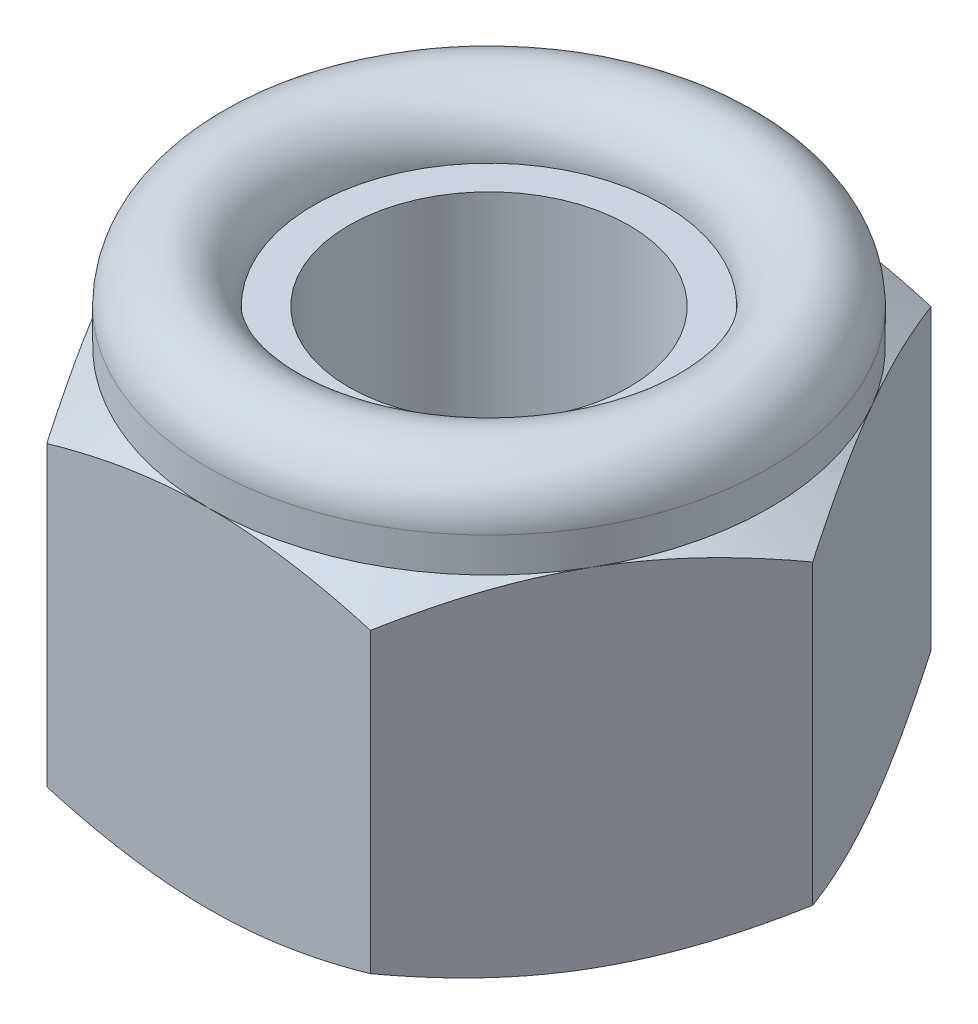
ISO-10303-21;
HEADER;
FILE_DESCRIPTION(('STEP AP214'),'2;1');
FILE_NAME('part.step','',(''),(''),'','','');
FILE_SCHEMA(('AUTOMOTIVE_DESIGN { 1 0 10303 214 1 1 1 1 }'));
ENDSEC;
DATA;
#1=APPLICATION_CONTEXT('core data for automotive mechanical design processes');
#2=APPLICATION_PROTOCOL_DEFINITION('international standard','automotive_design',2000,#1);
#3=PRODUCT_CONTEXT('',#1,'mechanical');
#4=PRODUCT('Part','Part','',(#3));
#5=PRODUCT_RELATED_PRODUCT_CATEGORY('part','',(#4));
#6=PRODUCT_DEFINITION_FORMATION('','',#4);
#7=PRODUCT_DEFINITION_CONTEXT('part definition',#1,'design');
#8=PRODUCT_DEFINITION('design','',#6,#7);
#9=PRODUCT_DEFINITION_SHAPE('','',#8);
#10=(LENGTH_UNIT() NAMED_UNIT(*) SI_UNIT(.MILLI.,.METRE.));
#11=(NAMED_UNIT(*) PLANE_ANGLE_UNIT() SI_UNIT($,.RADIAN.));
#12=(NAMED_UNIT(*) SI_UNIT($,.STERADIAN.) SOLID_ANGLE_UNIT());
#13=UNCERTAINTY_MEASURE_WITH_UNIT(LENGTH_MEASURE(1.E-05),#10,'distance_accuracy_value','');
#14=(GEOMETRIC_REPRESENTATION_CONTEXT(3) GLOBAL_UNCERTAINTY_ASSIGNED_CONTEXT((#13)) GLOBAL_UNIT_ASSIGNED_CONTEXT((#10,
#11,#12)) REPRESENTATION_CONTEXT('',''));
#15=CARTESIAN_POINT('',(0.,0.,0.));
#16=DIRECTION('',(0.,0.,1.));
#17=DIRECTION('',(1.,0.,0.));
#18=AXIS2_PLACEMENT_3D('',#15,#16,#17);
#19=CARTESIAN_POINT('',(0.,0.,0.));
#20=DIRECTION('',(0.,1.,0.));
#21=DIRECTION('',(0.,0.,1.));
#22=AXIS2_PLACEMENT_3D('',#19,#20,#21);
#23=CONICAL_SURFACE('',#22,8.00000001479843,1.04719754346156);
#24=CARTESIAN_POINT('',(9.23771977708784,0.714597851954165,0.000199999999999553));
#25=CARTESIAN_POINT('',(9.13619343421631,0.655990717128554,-0.175648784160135));
#26=CARTESIAN_POINT('',(9.03428856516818,0.600043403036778,-0.35215319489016));
#27=CARTESIAN_POINT('',(8.82965122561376,0.494201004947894,-0.706595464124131));
#28=CARTESIAN_POINT('',(8.72691841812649,0.444308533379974,-0.884533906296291));
#29=CARTESIAN_POINT('',(8.41707512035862,0.304692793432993,-1.42119824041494));
#30=CARTESIAN_POINT('',(8.20874154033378,0.225281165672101,-1.78204258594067));
#31=CARTESIAN_POINT('',(7.89697436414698,0.132161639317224,-2.32203917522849));
#32=CARTESIAN_POINT('',(7.79447216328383,0.105634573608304,-2.4995781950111));
#33=CARTESIAN_POINT('',(7.58900421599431,0.0611531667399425,-2.85545911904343));
#34=CARTESIAN_POINT('',(7.48603851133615,0.0431980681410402,-3.0338009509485));
#35=CARTESIAN_POINT('',(7.2799298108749,0.0163156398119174,-3.39079169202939));
#36=CARTESIAN_POINT('',(7.17678714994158,0.00737806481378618,-3.56944002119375));
#37=CARTESIAN_POINT('',(6.97040654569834,-0.00127770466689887,-3.9269017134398));
#38=CARTESIAN_POINT('',(6.86716860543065,-0.000996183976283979,-4.1057150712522));
#39=CARTESIAN_POINT('',(6.67416138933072,0.00814501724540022,-4.44001337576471));
#40=CARTESIAN_POINT('',(6.58437849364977,0.0158895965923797,-4.59552191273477));
#41=CARTESIAN_POINT('',(6.40502298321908,0.0382011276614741,-4.90617476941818));
#42=CARTESIAN_POINT('',(6.31545038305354,0.0527685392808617,-5.06131906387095));
#43=CARTESIAN_POINT('',(6.04707935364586,0.106360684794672,-5.52615132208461));
#44=CARTESIAN_POINT('',(5.86875596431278,0.155268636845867,-5.83501649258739));
#45=CARTESIAN_POINT('',(5.51021755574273,0.277539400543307,-6.45602323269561));
#46=CARTESIAN_POINT('',(5.33004829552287,0.35142051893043,-6.76808554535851));
#47=CARTESIAN_POINT('',(4.97239658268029,0.519100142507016,-7.3875564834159));
#48=CARTESIAN_POINT('',(4.79490954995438,0.61285926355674,-7.69497304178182));
#49=CARTESIAN_POINT('',(4.61868668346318,0.714597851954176,-8.0002));
#50=B_SPLINE_CURVE_WITH_KNOTS('',3,(#24,#25,#26,#27,#28,#29,#30,#31,#32,#33,#34,#35,#36,#37,#38,
#39,#40,#41,#42,#43,#44,#45,#46,#47,#48,#49),.UNSPECIFIED.,.F.,.F.,(4,2,2,2,2,2,2,2,2,2,2,2,4),
(0.,0.633973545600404,1.2682196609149,2.53934713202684,3.15934344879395,3.7792849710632,
4.39852135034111,5.01773859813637,5.55680240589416,6.09590255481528,7.17487078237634,
8.27776850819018,9.37850115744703),.UNSPECIFIED.);
#51=CARTESIAN_POINT('',(9.237604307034,0.714531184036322,0.));
#52=VERTEX_POINT('',#51);
#53=CARTESIAN_POINT('',(6.92820323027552,0.,-3.99999999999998));
#54=VERTEX_POINT('',#53);
#55=EDGE_CURVE('E238',#52,#54,#50,.T.);
#56=ORIENTED_EDGE('',*,*,#55,.F.);
#57=CARTESIAN_POINT('',(4.61868668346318,0.714597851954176,8.0002));
#58=CARTESIAN_POINT('',(4.7202130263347,0.655990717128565,7.82435121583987));
#59=CARTESIAN_POINT('',(4.82211789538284,0.600043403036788,7.64784680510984));
#60=CARTESIAN_POINT('',(5.02675523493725,0.494201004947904,7.29340453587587));
#61=CARTESIAN_POINT('',(5.12948804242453,0.444308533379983,7.11546609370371));
#62=CARTESIAN_POINT('',(5.4393313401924,0.304692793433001,6.57880175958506));
#63=CARTESIAN_POINT('',(5.64766492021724,0.225281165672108,6.21795741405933));
#64=CARTESIAN_POINT('',(5.95943209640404,0.132161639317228,5.67796082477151));
#65=CARTESIAN_POINT('',(6.06193429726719,0.105634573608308,5.5004218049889));
#66=CARTESIAN_POINT('',(6.26740224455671,0.0611531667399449,5.14454088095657));
#67=CARTESIAN_POINT('',(6.37036794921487,0.0431980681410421,4.96619904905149));
#68=CARTESIAN_POINT('',(6.57647664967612,0.0163156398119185,4.60920830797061));
#69=CARTESIAN_POINT('',(6.67961931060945,0.00737806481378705,4.43055997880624));
#70=CARTESIAN_POINT('',(6.88599991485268,-0.00127770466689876,4.07309828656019));
#71=CARTESIAN_POINT('',(6.98923785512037,-0.000996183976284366,3.89428492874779));
#72=CARTESIAN_POINT('',(7.1822450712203,0.00814501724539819,3.55998662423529));
#73=CARTESIAN_POINT('',(7.27202796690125,0.0158895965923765,3.40447808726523));
#74=CARTESIAN_POINT('',(7.45138347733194,0.0382011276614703,3.09382523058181));
#75=CARTESIAN_POINT('',(7.54095607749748,0.0527685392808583,2.93868093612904));
#76=CARTESIAN_POINT('',(7.80932710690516,0.106360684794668,2.47384867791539));
#77=CARTESIAN_POINT('',(7.98765049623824,0.15526863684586,2.16498350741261));
#78=CARTESIAN_POINT('',(8.34618890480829,0.277539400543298,1.54397676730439));
#79=CARTESIAN_POINT('',(8.52635816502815,0.351420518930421,1.23191445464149));
#80=CARTESIAN_POINT('',(8.88400987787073,0.519100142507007,0.612443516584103));
#81=CARTESIAN_POINT('',(9.06149691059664,0.61285926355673,0.30502695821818));
#82=CARTESIAN_POINT('',(9.23771977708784,0.714597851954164,-0.000200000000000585));
#83=B_SPLINE_CURVE_WITH_KNOTS('',3,(#57,#58,#59,#60,#61,#62,#63,#64,#65,#66,#67,#68,#69,#70,#71,
#72,#73,#74,#75,#76,#77,#78,#79,#80,#81,#82),.UNSPECIFIED.,.F.,.F.,(4,2,2,2,2,2,2,2,2,2,2,2,4),
(0.,0.633973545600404,1.2682196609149,2.53934713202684,3.15934344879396,3.7792849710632,
4.39852135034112,5.01773859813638,5.55680240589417,6.09590255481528,7.17487078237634,
8.27776850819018,9.37850115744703),.UNSPECIFIED.);
#84=CARTESIAN_POINT('',(6.92820323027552,0.,3.99999999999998));
#85=VERTEX_POINT('',#84);
#86=EDGE_CURVE('E153',#85,#52,#83,.T.);
#87=ORIENTED_EDGE('',*,*,#86,.F.);
#88=CARTESIAN_POINT('',(0.,0.,0.));
#89=DIRECTION('',(0.,-1.,0.));
#90=DIRECTION('',(0.,0.,-1.));
#91=AXIS2_PLACEMENT_3D('',#88,#89,#90);
#92=CIRCLE('',#91,8.00000001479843);
#93=EDGE_CURVE('E251',#54,#85,#92,.T.);
#94=ORIENTED_EDGE('',*,*,#93,.F.);
#95=EDGE_LOOP('',(#56,#87,#94));
#96=FACE_BOUND('',#95,.T.);
#97=ADVANCED_FACE('F35',(#96),#23,.T.);
#98=CARTESIAN_POINT('',(4.61880215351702,0.714531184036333,-8.));
#99=VERTEX_POINT('',#98);
#100=EDGE_CURVE('E233',#54,#99,#50,.T.);
#101=ORIENTED_EDGE('',*,*,#100,.F.);
#102=CARTESIAN_POINT('',(0.,0.,-8.));
#103=VERTEX_POINT('',#102);
#104=EDGE_CURVE('E249',#103,#54,#92,.T.);
#105=ORIENTED_EDGE('',*,*,#104,.F.);
#106=CARTESIAN_POINT('',(-12.4167804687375,3.90912139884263,-8.));
#107=CARTESIAN_POINT('',(-12.0672904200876,3.73954675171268,-8.));
#108=CARTESIAN_POINT('',(-11.716999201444,3.57159509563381,-8.));
#109=CARTESIAN_POINT('',(-11.0143884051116,3.23985033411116,-8.));
#110=CARTESIAN_POINT('',(-10.6620685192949,3.07605788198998,-8.));
#111=CARTESIAN_POINT('',(-9.95316389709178,2.75272219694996,-8.));
#112=CARTESIAN_POINT('',(-9.59656639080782,2.59320686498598,-8.));
#113=CARTESIAN_POINT('',(-8.88053882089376,2.28069031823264,-8.));
#114=CARTESIAN_POINT('',(-8.52110889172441,2.12768879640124,-8.));
#115=CARTESIAN_POINT('',(-7.78718797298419,1.82511353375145,-8.));
#116=CARTESIAN_POINT('',(-7.41258514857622,1.67580955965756,-8.));
#117=CARTESIAN_POINT('',(-6.65900149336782,1.38847695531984,-8.));
#118=CARTESIAN_POINT('',(-6.28002017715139,1.25044958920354,-8.));
#119=CARTESIAN_POINT('',(-5.51777815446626,0.989286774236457,-8.));
#120=CARTESIAN_POINT('',(-5.13452785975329,0.866121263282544,-8.));
#121=CARTESIAN_POINT('',(-4.36254331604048,0.63862615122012,-8.));
#122=CARTESIAN_POINT('',(-3.97381083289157,0.534290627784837,-8.));
#123=CARTESIAN_POINT('',(-3.19274509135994,0.350020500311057,-8.));
#124=CARTESIAN_POINT('',(-2.80044413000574,0.269952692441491,-8.));
#125=CARTESIAN_POINT('',(-2.20841205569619,0.1715109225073,-8.));
#126=CARTESIAN_POINT('',(-2.01045675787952,0.142305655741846,-8.));
#127=CARTESIAN_POINT('',(-1.61355877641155,0.091687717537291,-8.));
#128=CARTESIAN_POINT('',(-1.41461619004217,0.0702742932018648,-8.));
#129=CARTESIAN_POINT('',(-1.01861322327,0.0359357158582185,-8.));
#130=CARTESIAN_POINT('',(-0.821562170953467,0.0229034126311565,-8.));
#131=CARTESIAN_POINT('',(-0.427085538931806,0.00518383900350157,-8.));
#132=CARTESIAN_POINT('',(-0.229659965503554,0.000496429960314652,-8.));
#133=CARTESIAN_POINT('',(0.165212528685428,-0.000421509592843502,-8.));
#134=CARTESIAN_POINT('',(0.362659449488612,0.00334797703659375,-8.));
#135=CARTESIAN_POINT('',(0.757218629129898,0.0192515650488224,-8.));
#136=CARTESIAN_POINT('',(0.954330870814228,0.031386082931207,-8.));
#137=CARTESIAN_POINT('',(1.42775544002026,0.0703195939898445,-8.));
#138=CARTESIAN_POINT('',(1.70374960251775,0.101071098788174,-8.));
#139=CARTESIAN_POINT('',(2.25368308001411,0.177298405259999,-8.));
#140=CARTESIAN_POINT('',(2.52762211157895,0.222776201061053,-8.));
#141=CARTESIAN_POINT('',(3.34604788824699,0.378887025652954,-8.));
#142=CARTESIAN_POINT('',(3.88683594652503,0.509168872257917,-8.));
#143=CARTESIAN_POINT('',(4.69544514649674,0.735008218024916,-8.));
#144=CARTESIAN_POINT('',(4.96746291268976,0.816403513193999,-8.));
#145=CARTESIAN_POINT('',(5.50885645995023,0.987629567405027,-8.));
#146=CARTESIAN_POINT('',(5.77823222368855,1.07746038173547,-8.));
#147=CARTESIAN_POINT('',(6.31442655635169,1.26411775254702,-8.));
#148=CARTESIAN_POINT('',(6.5812459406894,1.36094198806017,-8.));
#149=CARTESIAN_POINT('',(7.11267558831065,1.56044885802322,-8.));
#150=CARTESIAN_POINT('',(7.37728587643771,1.66313142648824,-8.));
#151=CARTESIAN_POINT('',(7.99738806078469,1.91040586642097,-8.));
#152=CARTESIAN_POINT('',(8.35207087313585,2.05702284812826,-8.));
#153=CARTESIAN_POINT('',(9.05844713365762,2.35730973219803,-8.));
#154=CARTESIAN_POINT('',(9.41014040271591,2.51098005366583,-8.));
#155=CARTESIAN_POINT('',(10.1110880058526,2.82397393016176,-8.));
#156=CARTESIAN_POINT('',(10.4603417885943,2.98329871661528,-8.));
#157=CARTESIAN_POINT('',(11.1567364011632,3.30647149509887,-8.));
#158=CARTESIAN_POINT('',(11.5038772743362,3.47031939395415,-8.));
#159=CARTESIAN_POINT('',(12.1967661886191,3.8018765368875,-8.));
#160=CARTESIAN_POINT('',(12.5425123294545,3.96958974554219,-8.));
#161=CARTESIAN_POINT('',(13.2325145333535,4.30805666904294,-8.));
#162=CARTESIAN_POINT('',(13.576770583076,4.47881041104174,-8.));
#163=CARTESIAN_POINT('',(14.6075665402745,4.994785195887,-8.));
#164=CARTESIAN_POINT('',(15.2922253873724,5.34376376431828,-8.));
#165=CARTESIAN_POINT('',(16.6012395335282,6.01954125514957,-8.));
#166=CARTESIAN_POINT('',(17.225885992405,6.34577870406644,-8.));
#167=CARTESIAN_POINT('',(18.4728402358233,7.00274166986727,-8.));
#168=CARTESIAN_POINT('',(19.0951479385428,7.33346734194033,-8.));
#169=CARTESIAN_POINT('',(20.3364009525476,7.99751999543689,-8.));
#170=CARTESIAN_POINT('',(20.9553507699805,8.33083856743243,-8.));
#171=CARTESIAN_POINT('',(22.1917522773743,9.00016358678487,-8.));
#172=CARTESIAN_POINT('',(22.8092040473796,9.33616988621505,-8.));
#173=CARTESIAN_POINT('',(23.4261032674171,9.67318077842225,-8.));
#174=B_SPLINE_CURVE_WITH_KNOTS('',3,(#106,#107,#108,#109,#110,#111,#112,#113,#114,#115,#116,
#117,#118,#119,#120,#121,#122,#123,#124,#125,#126,#127,#128,#129,#130,#131,#132,#133,#134,#135,
#136,#137,#138,#139,#140,#141,#142,#143,#144,#145,#146,#147,#148,#149,#150,#151,#152,#153,#154,
#155,#156,#157,#158,#159,#160,#161,#162,#163,#164,#165,#166,#167,#168,#169,#170,#171,#172,#173),
.UNSPECIFIED.,.F.,.F.,(4,2,2,2,2,2,2,2,2,2,2,2,2,2,2,2,2,2,2,2,2,2,2,2,2,2,2,2,2,2,2,2,2,4),(0.,
1.16538523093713,2.33095240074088,3.50284826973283,4.67468883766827,5.88432916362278,
7.0941049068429,8.30139100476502,9.50829672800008,10.7084525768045,11.308617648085,
11.9087247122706,12.5009984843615,13.093262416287,13.6855275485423,14.2778221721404,
15.1104579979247,15.9432066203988,17.6096258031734,18.4613586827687,19.3130971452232,
20.164554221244,21.0160017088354,22.1672759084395,23.3186186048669,24.4702135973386,
25.6217848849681,26.7745950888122,27.9274155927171,30.2327530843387,32.3468591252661,
34.4610384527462,36.5700125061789,38.6788712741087),.UNSPECIFIED.);
#175=EDGE_CURVE('E339',#99,#103,#174,.F.);
#176=ORIENTED_EDGE('',*,*,#175,.F.);
#177=EDGE_LOOP('',(#101,#105,#176));
#178=FACE_BOUND('',#177,.T.);
#179=ADVANCED_FACE('F269',(#178),#23,.T.);
#180=CARTESIAN_POINT('',(-4.61880215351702,0.714531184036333,-8.));
#181=VERTEX_POINT('',#180);
#182=EDGE_CURVE('E210',#103,#181,#174,.F.);
#183=ORIENTED_EDGE('',*,*,#182,.F.);
#184=CARTESIAN_POINT('',(-6.92820323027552,0.,-3.99999999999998));
#185=VERTEX_POINT('',#184);
#186=EDGE_CURVE('E247',#185,#103,#92,.T.);
#187=ORIENTED_EDGE('',*,*,#186,.F.);
#188=CARTESIAN_POINT('',(-4.61868668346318,0.714597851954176,-8.0002));
#189=CARTESIAN_POINT('',(-4.7202130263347,0.655990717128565,-7.82435121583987));
#190=CARTESIAN_POINT('',(-4.82211789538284,0.600043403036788,-7.64784680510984));
#191=CARTESIAN_POINT('',(-5.02675523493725,0.494201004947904,-7.29340453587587));
#192=CARTESIAN_POINT('',(-5.12948804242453,0.444308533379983,-7.11546609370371));
#193=CARTESIAN_POINT('',(-5.4393313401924,0.304692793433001,-6.57880175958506));
#194=CARTESIAN_POINT('',(-5.64766492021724,0.225281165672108,-6.21795741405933));
#195=CARTESIAN_POINT('',(-5.95943209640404,0.132161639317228,-5.67796082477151));
#196=CARTESIAN_POINT('',(-6.06193429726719,0.105634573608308,-5.5004218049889));
#197=CARTESIAN_POINT('',(-6.26740224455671,0.0611531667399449,-5.14454088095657));
#198=CARTESIAN_POINT('',(-6.37036794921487,0.0431980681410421,-4.96619904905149));
#199=CARTESIAN_POINT('',(-6.57647664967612,0.0163156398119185,-4.60920830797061));
#200=CARTESIAN_POINT('',(-6.67961931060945,0.00737806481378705,-4.43055997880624));
#201=CARTESIAN_POINT('',(-6.88599991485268,-0.00127770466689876,-4.07309828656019));
#202=CARTESIAN_POINT('',(-6.98923785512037,-0.000996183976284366,-3.89428492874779));
#203=CARTESIAN_POINT('',(-7.1822450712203,0.00814501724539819,-3.55998662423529));
#204=CARTESIAN_POINT('',(-7.27202796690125,0.0158895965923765,-3.40447808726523));
#205=CARTESIAN_POINT('',(-7.45138347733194,0.0382011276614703,-3.09382523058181));
#206=CARTESIAN_POINT('',(-7.54095607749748,0.0527685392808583,-2.93868093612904));
#207=CARTESIAN_POINT('',(-7.80932710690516,0.106360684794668,-2.47384867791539));
#208=CARTESIAN_POINT('',(-7.98765049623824,0.15526863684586,-2.16498350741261));
#209=CARTESIAN_POINT('',(-8.34618890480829,0.277539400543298,-1.54397676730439));
#210=CARTESIAN_POINT('',(-8.52635816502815,0.351420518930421,-1.23191445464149));
#211=CARTESIAN_POINT('',(-8.88400987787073,0.519100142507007,-0.612443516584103));
#212=CARTESIAN_POINT('',(-9.06149691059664,0.61285926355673,-0.30502695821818));
#213=CARTESIAN_POINT('',(-9.23771977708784,0.714597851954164,0.000200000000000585));
#214=B_SPLINE_CURVE_WITH_KNOTS('',3,(#188,#189,#190,#191,#192,#193,#194,#195,#196,#197,#198,
#199,#200,#201,#202,#203,#204,#205,#206,#207,#208,#209,#210,#211,#212,#213),.UNSPECIFIED.,.F.,
.F.,(4,2,2,2,2,2,2,2,2,2,2,2,4),(0.,0.633973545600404,1.2682196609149,2.53934713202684,
3.15934344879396,3.7792849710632,4.39852135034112,5.01773859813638,5.55680240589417,
6.09590255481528,7.17487078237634,8.27776850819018,9.37850115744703),.UNSPECIFIED.);
#215=EDGE_CURVE('E205',#181,#185,#214,.T.);
#216=ORIENTED_EDGE('',*,*,#215,.F.);
#217=EDGE_LOOP('',(#183,#187,#216));
#218=FACE_BOUND('',#217,.T.);
#219=ADVANCED_FACE('F274',(#218),#23,.T.);
#220=CARTESIAN_POINT('',(-9.237604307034,0.714531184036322,0.));
#221=VERTEX_POINT('',#220);
#222=EDGE_CURVE('E206',#185,#221,#214,.T.);
#223=ORIENTED_EDGE('',*,*,#222,.F.);
#224=CARTESIAN_POINT('',(-6.92820323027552,0.,3.99999999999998));
#225=VERTEX_POINT('',#224);
#226=EDGE_CURVE('E311',#225,#185,#92,.T.);
#227=ORIENTED_EDGE('',*,*,#226,.F.);
#228=CARTESIAN_POINT('',(-9.23771977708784,0.714597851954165,-0.0002));
#229=CARTESIAN_POINT('',(-9.13619343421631,0.655990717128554,0.175648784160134));
#230=CARTESIAN_POINT('',(-9.03428856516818,0.600043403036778,0.352153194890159));
#231=CARTESIAN_POINT('',(-8.82965122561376,0.494201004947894,0.70659546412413));
#232=CARTESIAN_POINT('',(-8.72691841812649,0.444308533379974,0.88453390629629));
#233=CARTESIAN_POINT('',(-8.41707512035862,0.304692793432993,1.42119824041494));
#234=CARTESIAN_POINT('',(-8.20874154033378,0.225281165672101,1.78204258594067));
#235=CARTESIAN_POINT('',(-7.89697436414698,0.132161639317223,2.32203917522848));
#236=CARTESIAN_POINT('',(-7.79447216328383,0.105634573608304,2.4995781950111));
#237=CARTESIAN_POINT('',(-7.58900421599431,0.0611531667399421,2.85545911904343));
#238=CARTESIAN_POINT('',(-7.48603851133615,0.0431980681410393,3.0338009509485));
#239=CARTESIAN_POINT('',(-7.2799298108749,0.0163156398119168,3.39079169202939));
#240=CARTESIAN_POINT('',(-7.17678714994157,0.00737806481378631,3.56944002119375));
#241=CARTESIAN_POINT('',(-6.97040654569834,-0.00127770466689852,3.9269017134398));
#242=CARTESIAN_POINT('',(-6.86716860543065,-0.000996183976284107,4.1057150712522));
#243=CARTESIAN_POINT('',(-6.67416138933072,0.00814501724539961,4.44001337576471));
#244=CARTESIAN_POINT('',(-6.58437849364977,0.015889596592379,4.59552191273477));
#245=CARTESIAN_POINT('',(-6.40502298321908,0.0382011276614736,4.90617476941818));
#246=CARTESIAN_POINT('',(-6.31545038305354,0.0527685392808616,5.06131906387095));
#247=CARTESIAN_POINT('',(-6.04707935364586,0.106360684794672,5.52615132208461));
#248=CARTESIAN_POINT('',(-5.86875596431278,0.155268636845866,5.83501649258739));
#249=CARTESIAN_POINT('',(-5.51021755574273,0.277539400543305,6.45602323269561));
#250=CARTESIAN_POINT('',(-5.33004829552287,0.351420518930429,6.76808554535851));
#251=CARTESIAN_POINT('',(-4.97239658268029,0.519100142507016,7.3875564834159));
#252=CARTESIAN_POINT('',(-4.79490954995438,0.61285926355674,7.69497304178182));
#253=CARTESIAN_POINT('',(-4.61868668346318,0.714597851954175,8.0002));
#254=B_SPLINE_CURVE_WITH_KNOTS('',3,(#228,#229,#230,#231,#232,#233,#234,#235,#236,#237,#238,
#239,#240,#241,#242,#243,#244,#245,#246,#247,#248,#249,#250,#251,#252,#253),.UNSPECIFIED.,.F.,
.F.,(4,2,2,2,2,2,2,2,2,2,2,2,4),(0.,0.633973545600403,1.2682196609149,2.53934713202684,
3.15934344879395,3.7792849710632,4.39852135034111,5.01773859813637,5.55680240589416,
6.09590255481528,7.17487078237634,8.27776850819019,9.37850115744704),.UNSPECIFIED.);
#255=EDGE_CURVE('E306',#221,#225,#254,.T.);
#256=ORIENTED_EDGE('',*,*,#255,.F.);
#257=EDGE_LOOP('',(#223,#227,#256));
#258=FACE_BOUND('',#257,.T.);
#259=ADVANCED_FACE('F286',(#258),#23,.T.);
#260=CARTESIAN_POINT('',(-4.61880215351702,0.714531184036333,8.));
#261=VERTEX_POINT('',#260);
#262=EDGE_CURVE('E298',#225,#261,#254,.T.);
#263=ORIENTED_EDGE('',*,*,#262,.F.);
#264=CARTESIAN_POINT('',(0.,0.,8.));
#265=VERTEX_POINT('',#264);
#266=EDGE_CURVE('E301',#265,#225,#92,.T.);
#267=ORIENTED_EDGE('',*,*,#266,.F.);
#268=CARTESIAN_POINT('',(-12.4167804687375,3.90912139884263,8.));
#269=CARTESIAN_POINT('',(-12.0672904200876,3.73954675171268,8.));
#270=CARTESIAN_POINT('',(-11.716999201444,3.57159509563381,8.));
#271=CARTESIAN_POINT('',(-11.0143884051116,3.23985033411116,8.));
#272=CARTESIAN_POINT('',(-10.6620685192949,3.07605788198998,8.));
#273=CARTESIAN_POINT('',(-9.95316389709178,2.75272219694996,8.));
#274=CARTESIAN_POINT('',(-9.59656639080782,2.59320686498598,8.));
#275=CARTESIAN_POINT('',(-8.88053882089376,2.28069031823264,8.));
#276=CARTESIAN_POINT('',(-8.52110889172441,2.12768879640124,8.));
#277=CARTESIAN_POINT('',(-7.78718797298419,1.82511353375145,8.));
#278=CARTESIAN_POINT('',(-7.41258514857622,1.67580955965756,8.));
#279=CARTESIAN_POINT('',(-6.65900149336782,1.38847695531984,8.));
#280=CARTESIAN_POINT('',(-6.28002017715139,1.25044958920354,8.));
#281=CARTESIAN_POINT('',(-5.51777815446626,0.989286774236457,8.));
#282=CARTESIAN_POINT('',(-5.13452785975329,0.866121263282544,8.));
#283=CARTESIAN_POINT('',(-4.36254331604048,0.63862615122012,8.));
#284=CARTESIAN_POINT('',(-3.97381083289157,0.534290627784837,8.));
#285=CARTESIAN_POINT('',(-3.19274509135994,0.350020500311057,8.));
#286=CARTESIAN_POINT('',(-2.80044413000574,0.269952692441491,8.));
#287=CARTESIAN_POINT('',(-2.20841205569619,0.1715109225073,8.));
#288=CARTESIAN_POINT('',(-2.01045675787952,0.142305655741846,8.));
#289=CARTESIAN_POINT('',(-1.61355877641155,0.091687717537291,8.));
#290=CARTESIAN_POINT('',(-1.41461619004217,0.0702742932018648,8.));
#291=CARTESIAN_POINT('',(-1.01861322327,0.0359357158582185,8.));
#292=CARTESIAN_POINT('',(-0.821562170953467,0.0229034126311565,8.));
#293=CARTESIAN_POINT('',(-0.427085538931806,0.00518383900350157,8.));
#294=CARTESIAN_POINT('',(-0.229659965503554,0.000496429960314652,8.));
#295=CARTESIAN_POINT('',(0.165212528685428,-0.000421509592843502,8.));
#296=CARTESIAN_POINT('',(0.362659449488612,0.00334797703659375,8.));
#297=CARTESIAN_POINT('',(0.757218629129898,0.0192515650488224,8.));
#298=CARTESIAN_POINT('',(0.954330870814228,0.031386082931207,8.));
#299=CARTESIAN_POINT('',(1.42775544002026,0.0703195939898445,8.));
#300=CARTESIAN_POINT('',(1.70374960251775,0.101071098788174,8.));
#301=CARTESIAN_POINT('',(2.25368308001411,0.177298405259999,8.));
#302=CARTESIAN_POINT('',(2.52762211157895,0.222776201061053,8.));
#303=CARTESIAN_POINT('',(3.34604788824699,0.378887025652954,8.));
#304=CARTESIAN_POINT('',(3.88683594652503,0.509168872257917,8.));
#305=CARTESIAN_POINT('',(4.69544514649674,0.735008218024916,8.));
#306=CARTESIAN_POINT('',(4.96746291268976,0.816403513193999,8.));
#307=CARTESIAN_POINT('',(5.50885645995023,0.987629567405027,8.));
#308=CARTESIAN_POINT('',(5.77823222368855,1.07746038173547,8.));
#309=CARTESIAN_POINT('',(6.31442655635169,1.26411775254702,8.));
#310=CARTESIAN_POINT('',(6.5812459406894,1.36094198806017,8.));
#311=CARTESIAN_POINT('',(7.11267558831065,1.56044885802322,8.));
#312=CARTESIAN_POINT('',(7.37728587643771,1.66313142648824,8.));
#313=CARTESIAN_POINT('',(7.99738806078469,1.91040586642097,8.));
#314=CARTESIAN_POINT('',(8.35207087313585,2.05702284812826,8.));
#315=CARTESIAN_POINT('',(9.05844713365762,2.35730973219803,8.));
#316=CARTESIAN_POINT('',(9.41014040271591,2.51098005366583,8.));
#317=CARTESIAN_POINT('',(10.1110880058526,2.82397393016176,8.));
#318=CARTESIAN_POINT('',(10.4603417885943,2.98329871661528,8.));
#319=CARTESIAN_POINT('',(11.1567364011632,3.30647149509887,8.));
#320=CARTESIAN_POINT('',(11.5038772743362,3.47031939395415,8.));
#321=CARTESIAN_POINT('',(12.1967661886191,3.8018765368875,8.));
#322=CARTESIAN_POINT('',(12.5425123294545,3.96958974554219,8.));
#323=CARTESIAN_POINT('',(13.2325145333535,4.30805666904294,8.));
#324=CARTESIAN_POINT('',(13.576770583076,4.47881041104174,8.));
#325=CARTESIAN_POINT('',(14.6075665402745,4.994785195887,8.));
#326=CARTESIAN_POINT('',(15.2922253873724,5.34376376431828,8.));
#327=CARTESIAN_POINT('',(16.6012395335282,6.01954125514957,8.));
#328=CARTESIAN_POINT('',(17.225885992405,6.34577870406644,8.));
#329=CARTESIAN_POINT('',(18.4728402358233,7.00274166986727,8.));
#330=CARTESIAN_POINT('',(19.0951479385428,7.33346734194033,8.));
#331=CARTESIAN_POINT('',(20.3364009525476,7.99751999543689,8.));
#332=CARTESIAN_POINT('',(20.9553507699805,8.33083856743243,8.));
#333=CARTESIAN_POINT('',(22.1917522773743,9.00016358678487,8.));
#334=CARTESIAN_POINT('',(22.8092040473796,9.33616988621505,8.));
#335=CARTESIAN_POINT('',(23.4261032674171,9.67318077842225,8.));
#336=B_SPLINE_CURVE_WITH_KNOTS('',3,(#268,#269,#270,#271,#272,#273,#274,#275,#276,#277,#278,
#279,#280,#281,#282,#283,#284,#285,#286,#287,#288,#289,#290,#291,#292,#293,#294,#295,#296,#297,
#298,#299,#300,#301,#302,#303,#304,#305,#306,#307,#308,#309,#310,#311,#312,#313,#314,#315,#316,
#317,#318,#319,#320,#321,#322,#323,#324,#325,#326,#327,#328,#329,#330,#331,#332,#333,#334,#335),
.UNSPECIFIED.,.F.,.F.,(4,2,2,2,2,2,2,2,2,2,2,2,2,2,2,2,2,2,2,2,2,2,2,2,2,2,2,2,2,2,2,2,2,4),(0.,
1.16538523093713,2.33095240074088,3.50284826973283,4.67468883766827,5.88432916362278,
7.0941049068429,8.30139100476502,9.50829672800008,10.7084525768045,11.308617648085,
11.9087247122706,12.5009984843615,13.093262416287,13.6855275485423,14.2778221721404,
15.1104579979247,15.9432066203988,17.6096258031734,18.4613586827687,19.3130971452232,
20.164554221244,21.0160017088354,22.1672759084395,23.3186186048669,24.4702135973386,
25.6217848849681,26.7745950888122,27.9274155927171,30.2327530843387,32.3468591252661,
34.4610384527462,36.5700125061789,38.6788712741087),.UNSPECIFIED.);
#337=EDGE_CURVE('E145',#261,#265,#336,.T.);
#338=ORIENTED_EDGE('',*,*,#337,.F.);
#339=EDGE_LOOP('',(#263,#267,#338));
#340=FACE_BOUND('',#339,.T.);
#341=ADVANCED_FACE('F280',(#340),#23,.T.);
#342=CARTESIAN_POINT('',(0.,7.99999999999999,0.));
#343=DIRECTION('',(0.,-1.,0.));
#344=DIRECTION('',(0.,0.,-1.));
#345=AXIS2_PLACEMENT_3D('',#342,#343,#344);
#346=CONICAL_SURFACE('',#345,11.3137084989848,1.04719755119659);
#347=CARTESIAN_POINT('',(-9.23771977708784,9.19857264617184,0.0002));
#348=CARTESIAN_POINT('',(-9.13619343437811,9.25717977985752,-0.175648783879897));
#349=CARTESIAN_POINT('',(-9.03428856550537,9.31312709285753,-0.352153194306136));
#350=CARTESIAN_POINT('',(-8.82965122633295,9.41896948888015,-0.706595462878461));
#351=CARTESIAN_POINT('',(-8.72691841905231,9.46886195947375,-0.884533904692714));
#352=CARTESIAN_POINT('',(-8.41707512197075,9.60847769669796,-1.42119823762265));
#353=CARTESIAN_POINT('',(-8.20874154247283,9.68788932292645,-1.78204258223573));
#354=CARTESIAN_POINT('',(-7.89697436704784,9.78100884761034,-2.32203917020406));
#355=CARTESIAN_POINT('',(-7.79447216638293,9.8075359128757,-2.49957818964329));
#356=CARTESIAN_POINT('',(-7.58900421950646,9.85201731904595,-2.85545911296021));
#357=CARTESIAN_POINT('',(-7.48603851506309,9.86997241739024,-3.03380094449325));
#358=CARTESIAN_POINT('',(-7.27992981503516,9.89685484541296,-3.3907916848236));
#359=CARTESIAN_POINT('',(-7.17678715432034,9.90579242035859,-3.56944001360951));
#360=CARTESIAN_POINT('',(-6.97040655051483,9.91444818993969,-3.92690170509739));
#361=CARTESIAN_POINT('',(-6.86716861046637,9.91416666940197,-4.10571506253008));
#362=CARTESIAN_POINT('',(-6.67416139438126,9.90502546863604,-4.44001336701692));
#363=CARTESIAN_POINT('',(-6.58437849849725,9.89728088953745,-4.59552190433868));
#364=CARTESIAN_POINT('',(-6.40502298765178,9.87496935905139,-4.90617476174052));
#365=CARTESIAN_POINT('',(-6.31545038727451,9.86040194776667,-5.06131905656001));
#366=CARTESIAN_POINT('',(-6.04707935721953,9.80680980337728,-5.52615131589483));
#367=CARTESIAN_POINT('',(-5.86875596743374,9.75790185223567,-5.83501648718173));
#368=CARTESIAN_POINT('',(-5.51021755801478,9.6356310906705,-6.45602322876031));
#369=CARTESIAN_POINT('',(-5.33004829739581,9.56174997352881,-6.76808554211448));
#370=CARTESIAN_POINT('',(-4.97239658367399,9.39407035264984,-7.38755648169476));
#371=CARTESIAN_POINT('',(-4.79490955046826,9.30031123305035,-7.69497304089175));
#372=CARTESIAN_POINT('',(-4.61868668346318,9.19857264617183,-8.0002));
#373=B_SPLINE_CURVE_WITH_KNOTS('',3,(#347,#348,#349,#350,#351,#352,#353,#354,#355,#356,#357,
#358,#359,#360,#361,#362,#363,#364,#365,#366,#367,#368,#369,#370,#371,#372),.UNSPECIFIED.,.F.,
.F.,(4,2,2,2,2,2,2,2,2,2,2,2,4),(0.,0.633973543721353,1.26821965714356,2.53934712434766,
3.15934343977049,3.77928496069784,4.39852133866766,5.01773858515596,5.55680239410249,
6.09590254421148,7.17487077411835,8.27776850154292,9.37850115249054),.UNSPECIFIED.);
#374=CARTESIAN_POINT('',(-9.237604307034,9.19863931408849,0.));
#375=VERTEX_POINT('',#374);
#376=CARTESIAN_POINT('',(-6.92820323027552,9.91317049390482,-3.99999999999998));
#377=VERTEX_POINT('',#376);
#378=EDGE_CURVE('E366',#375,#377,#373,.T.);
#379=ORIENTED_EDGE('',*,*,#378,.F.);
#380=CARTESIAN_POINT('',(-4.61868668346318,9.19857264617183,8.0002));
#381=CARTESIAN_POINT('',(-4.72021302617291,9.25717977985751,7.8243512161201));
#382=CARTESIAN_POINT('',(-4.82211789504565,9.31312709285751,7.64784680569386));
#383=CARTESIAN_POINT('',(-5.02675523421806,9.41896948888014,7.29340453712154));
#384=CARTESIAN_POINT('',(-5.12948804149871,9.46886195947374,7.11546609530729));
#385=CARTESIAN_POINT('',(-5.43933133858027,9.60847769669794,6.57880176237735));
#386=CARTESIAN_POINT('',(-5.64766491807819,9.68788932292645,6.21795741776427));
#387=CARTESIAN_POINT('',(-5.95943209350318,9.78100884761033,5.67796082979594));
#388=CARTESIAN_POINT('',(-6.06193429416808,9.80753591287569,5.50042181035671));
#389=CARTESIAN_POINT('',(-6.26740224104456,9.85201731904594,5.14454088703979));
#390=CARTESIAN_POINT('',(-6.37036794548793,9.86997241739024,4.96619905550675));
#391=CARTESIAN_POINT('',(-6.57647664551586,9.89685484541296,4.60920831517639));
#392=CARTESIAN_POINT('',(-6.67961930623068,9.90579242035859,4.43055998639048));
#393=CARTESIAN_POINT('',(-6.88599991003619,9.91444818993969,4.0730982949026));
#394=CARTESIAN_POINT('',(-6.98923785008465,9.91416666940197,3.89428493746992));
#395=CARTESIAN_POINT('',(-7.18224506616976,9.90502546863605,3.55998663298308));
#396=CARTESIAN_POINT('',(-7.27202796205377,9.89728088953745,3.40447809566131));
#397=CARTESIAN_POINT('',(-7.45138347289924,9.87496935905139,3.09382523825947));
#398=CARTESIAN_POINT('',(-7.54095607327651,9.86040194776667,2.93868094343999));
#399=CARTESIAN_POINT('',(-7.80932710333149,9.80680980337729,2.47384868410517));
#400=CARTESIAN_POINT('',(-7.98765049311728,9.75790185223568,2.16498351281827));
#401=CARTESIAN_POINT('',(-8.34618890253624,9.63563109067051,1.54397677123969));
#402=CARTESIAN_POINT('',(-8.52635816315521,9.56174997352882,1.23191445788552));
#403=CARTESIAN_POINT('',(-8.88400987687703,9.39407035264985,0.612443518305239));
#404=CARTESIAN_POINT('',(-9.06149691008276,9.30031123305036,0.305026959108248));
#405=CARTESIAN_POINT('',(-9.23771977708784,9.19857264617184,-0.000200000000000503));
#406=B_SPLINE_CURVE_WITH_KNOTS('',3,(#380,#381,#382,#383,#384,#385,#386,#387,#388,#389,#390,
#391,#392,#393,#394,#395,#396,#397,#398,#399,#400,#401,#402,#403,#404,#405),.UNSPECIFIED.,.F.,
.F.,(4,2,2,2,2,2,2,2,2,2,2,2,4),(0.,0.633973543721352,1.26821965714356,2.53934712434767,
3.1593434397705,3.77928496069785,4.39852133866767,5.01773858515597,5.5568023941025,
6.09590254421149,7.17487077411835,8.27776850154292,9.37850115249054),.UNSPECIFIED.);
#407=CARTESIAN_POINT('',(-6.92820323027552,9.91317049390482,3.99999999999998));
#408=VERTEX_POINT('',#407);
#409=EDGE_CURVE('E185',#408,#375,#406,.T.);
#410=ORIENTED_EDGE('',*,*,#409,.F.);
#411=CARTESIAN_POINT('',(0.,9.91317049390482,0.));
#412=DIRECTION('',(0.,-1.,0.));
#413=DIRECTION('',(0.,0.,-1.));
#414=AXIS2_PLACEMENT_3D('',#411,#412,#413);
#415=CIRCLE('',#414,8.);
#416=EDGE_CURVE('E355',#408,#377,#415,.T.);
#417=ORIENTED_EDGE('',*,*,#416,.T.);
#418=EDGE_LOOP('',(#379,#410,#417));
#419=FACE_BOUND('',#418,.T.);
#420=ADVANCED_FACE('F170',(#419),#346,.T.);
#421=CARTESIAN_POINT('',(-4.61880215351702,9.19863931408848,-8.));
#422=VERTEX_POINT('',#421);
#423=EDGE_CURVE('E191',#377,#422,#373,.T.);
#424=ORIENTED_EDGE('',*,*,#423,.F.);
#425=CARTESIAN_POINT('',(0.,9.91317049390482,-8.));
#426=VERTEX_POINT('',#425);
#427=EDGE_CURVE('E243',#377,#426,#415,.T.);
#428=ORIENTED_EDGE('',*,*,#427,.T.);
#429=CARTESIAN_POINT('',(-12.4167804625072,6.00404915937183,-8.));
#430=CARTESIAN_POINT('',(-12.067290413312,6.17362380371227,-8.));
#431=CARTESIAN_POINT('',(-11.7169991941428,6.34157545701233,-8.));
#432=CARTESIAN_POINT('',(-11.0143883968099,6.6733202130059,-8.));
#433=CARTESIAN_POINT('',(-10.6620685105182,6.83711266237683,-8.));
#434=CARTESIAN_POINT('',(-9.95316388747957,7.16044834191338,-8.));
#435=CARTESIAN_POINT('',(-9.59656638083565,7.31996367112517,-8.));
#436=CARTESIAN_POINT('',(-8.88053881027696,7.63248021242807,-8.));
#437=CARTESIAN_POINT('',(-8.52110888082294,7.7854817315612,-8.));
#438=CARTESIAN_POINT('',(-7.78718796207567,8.0880569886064,-8.));
#439=CARTESIAN_POINT('',(-7.41258513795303,8.23736095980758,-8.));
#440=CARTESIAN_POINT('',(-6.65900148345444,8.52469355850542,-8.));
#441=CARTESIAN_POINT('',(-6.28002016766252,8.6627209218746,-8.));
#442=CARTESIAN_POINT('',(-5.51777814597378,8.92388373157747,-8.));
#443=CARTESIAN_POINT('',(-5.13452785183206,9.04704924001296,-8.));
#444=CARTESIAN_POINT('',(-4.3625433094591,9.2745443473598,-8.));
#445=CARTESIAN_POINT('',(-3.97381082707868,9.37887986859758,-8.));
#446=CARTESIAN_POINT('',(-3.19274508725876,9.5631499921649,-8.));
#447=CARTESIAN_POINT('',(-2.80044412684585,9.64321779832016,-8.));
#448=CARTESIAN_POINT('',(-2.20841205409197,9.74165956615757,-8.));
#449=CARTESIAN_POINT('',(-2.01045675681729,9.77086483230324,-8.));
#450=CARTESIAN_POINT('',(-1.61355877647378,9.82148276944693,-8.));
#451=CARTESIAN_POINT('',(-1.41461619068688,9.84289619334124,-8.));
#452=CARTESIAN_POINT('',(-1.01861322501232,9.87723477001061,-8.));
#453=CARTESIAN_POINT('',(-0.821562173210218,9.89026707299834,-8.));
#454=CARTESIAN_POINT('',(-0.427085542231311,9.90798664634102,-8.));
#455=CARTESIAN_POINT('',(-0.229659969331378,9.91267405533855,-8.));
#456=CARTESIAN_POINT('',(0.165212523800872,9.91359199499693,-8.));
#457=CARTESIAN_POINT('',(0.362659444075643,9.90982250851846,-8.));
#458=CARTESIAN_POINT('',(0.757218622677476,9.89391892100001,-8.));
#459=CARTESIAN_POINT('',(0.954330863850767,9.88178440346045,-8.));
#460=CARTESIAN_POINT('',(1.42775543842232,9.84285089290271,-8.));
#461=CARTESIAN_POINT('',(1.70374960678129,9.81209938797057,-8.));
#462=CARTESIAN_POINT('',(2.25368309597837,9.73587208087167,-8.));
#463=CARTESIAN_POINT('',(2.52762213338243,9.69039428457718,-8.));
#464=CARTESIAN_POINT('',(3.34604792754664,9.53428345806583,-8.));
#465=CARTESIAN_POINT('',(3.88683599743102,9.40400160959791,-8.));
#466=CARTESIAN_POINT('',(4.69544521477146,9.17816226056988,-8.));
#467=CARTESIAN_POINT('',(4.96746298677,9.09676696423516,-8.));
#468=CARTESIAN_POINT('',(5.50885654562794,8.92554090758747,-8.));
#469=CARTESIAN_POINT('',(5.77823231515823,8.83571009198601,-8.));
#470=CARTESIAN_POINT('',(6.31442665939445,8.64905271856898,-8.));
#471=CARTESIAN_POINT('',(6.58124604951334,8.55222848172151,-8.));
#472=CARTESIAN_POINT('',(7.11267570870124,8.35272160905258,-8.));
#473=CARTESIAN_POINT('',(7.37728600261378,8.250039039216,-8.));
#474=CARTESIAN_POINT('',(7.99738819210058,8.00276459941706,-8.));
#475=CARTESIAN_POINT('',(8.35207100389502,7.85614761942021,-8.));
#476=CARTESIAN_POINT('',(9.05844726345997,7.55586073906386,-8.));
#477=CARTESIAN_POINT('',(9.41014053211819,7.4021904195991,-8.));
#478=CARTESIAN_POINT('',(10.111088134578,7.08919654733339,-8.));
#479=CARTESIAN_POINT('',(10.460341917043,6.92987176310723,-8.));
#480=CARTESIAN_POINT('',(11.1567365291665,6.60669898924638,-8.));
#481=CARTESIAN_POINT('',(11.5038774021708,6.44285109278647,-8.));
#482=CARTESIAN_POINT('',(12.1967663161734,6.11129395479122,-8.));
#483=CARTESIAN_POINT('',(12.5425124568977,5.94358074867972,-8.));
#484=CARTESIAN_POINT('',(13.2325146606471,5.60511383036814,-8.));
#485=CARTESIAN_POINT('',(13.5767707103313,5.43436009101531,-8.));
#486=CARTESIAN_POINT('',(14.6075666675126,4.9183853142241,-8.));
#487=CARTESIAN_POINT('',(15.2922255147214,4.56940675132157,-8.));
#488=CARTESIAN_POINT('',(16.6012396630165,3.8936292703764,-8.));
#489=CARTESIAN_POINT('',(17.2258861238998,3.56739182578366,-8.));
#490=CARTESIAN_POINT('',(18.4728403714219,2.91042886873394,-8.));
#491=CARTESIAN_POINT('',(19.0951480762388,2.57970320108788,-8.));
#492=CARTESIAN_POINT('',(20.336401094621,1.9156505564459,-8.));
#493=CARTESIAN_POINT('',(20.9553509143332,1.58233198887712,-8.));
#494=CARTESIAN_POINT('',(22.1917524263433,0.913006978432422,-8.));
#495=CARTESIAN_POINT('',(22.8092041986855,0.577000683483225,-8.));
#496=CARTESIAN_POINT('',(23.4261034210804,0.239989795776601,-8.));
#497=B_SPLINE_CURVE_WITH_KNOTS('',3,(#429,#430,#431,#432,#433,#434,#435,#436,#437,#438,#439,
#440,#441,#442,#443,#444,#445,#446,#447,#448,#449,#450,#451,#452,#453,#454,#455,#456,#457,#458,
#459,#460,#461,#462,#463,#464,#465,#466,#467,#468,#469,#470,#471,#472,#473,#474,#475,#476,#477,
#478,#479,#480,#481,#482,#483,#484,#485,#486,#487,#488,#489,#490,#491,#492,#493,#494,#495,#496),
.UNSPECIFIED.,.F.,.F.,(4,2,2,2,2,2,2,2,2,2,2,2,2,2,2,2,2,2,2,2,2,2,2,2,2,2,2,2,2,2,2,2,2,4),(0.,
1.16538522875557,2.33095239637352,3.50284826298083,4.67468882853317,5.88432915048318,
7.09410488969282,8.30139098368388,9.50829670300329,10.7084525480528,11.3086176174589,
11.9087246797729,12.5009984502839,13.0932623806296,13.685527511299,14.2778221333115,
15.1104579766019,15.9432066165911,17.6096258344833,18.4613587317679,19.3130972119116,
20.1645543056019,21.0160018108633,22.167276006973,23.3186186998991,24.4702136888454,
25.6217849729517,26.7745951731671,27.9274156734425,30.2327531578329,32.3468591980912,
34.4610385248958,36.5700125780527,38.6788713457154),.UNSPECIFIED.);
#498=EDGE_CURVE('E204',#422,#426,#497,.T.);
#499=ORIENTED_EDGE('',*,*,#498,.F.);
#500=EDGE_LOOP('',(#424,#428,#499));
#501=FACE_BOUND('',#500,.T.);
#502=ADVANCED_FACE('F292',(#501),#346,.T.);
#503=CARTESIAN_POINT('',(4.61880215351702,9.19863931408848,-8.));
#504=VERTEX_POINT('',#503);
#505=EDGE_CURVE('E198',#426,#504,#497,.T.);
#506=ORIENTED_EDGE('',*,*,#505,.F.);
#507=CARTESIAN_POINT('',(6.92820323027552,9.91317049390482,-3.99999999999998));
#508=VERTEX_POINT('',#507);
#509=EDGE_CURVE('E244',#426,#508,#415,.T.);
#510=ORIENTED_EDGE('',*,*,#509,.T.);
#511=CARTESIAN_POINT('',(4.61868668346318,9.19857264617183,-8.0002));
#512=CARTESIAN_POINT('',(4.72021302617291,9.25717977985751,-7.8243512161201));
#513=CARTESIAN_POINT('',(4.82211789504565,9.31312709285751,-7.64784680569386));
#514=CARTESIAN_POINT('',(5.02675523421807,9.41896948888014,-7.29340453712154));
#515=CARTESIAN_POINT('',(5.12948804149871,9.46886195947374,-7.11546609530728));
#516=CARTESIAN_POINT('',(5.43933133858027,9.60847769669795,-6.57880176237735));
#517=CARTESIAN_POINT('',(5.64766491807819,9.68788932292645,-6.21795741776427));
#518=CARTESIAN_POINT('',(5.95943209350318,9.78100884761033,-5.67796082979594));
#519=CARTESIAN_POINT('',(6.06193429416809,9.80753591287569,-5.5004218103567));
#520=CARTESIAN_POINT('',(6.26740224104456,9.85201731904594,-5.14454088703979));
#521=CARTESIAN_POINT('',(6.37036794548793,9.86997241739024,-4.96619905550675));
#522=CARTESIAN_POINT('',(6.57647664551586,9.89685484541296,-4.60920831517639));
#523=CARTESIAN_POINT('',(6.67961930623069,9.90579242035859,-4.43055998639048));
#524=CARTESIAN_POINT('',(6.88599991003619,9.91444818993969,-4.0730982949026));
#525=CARTESIAN_POINT('',(6.98923785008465,9.91416666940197,-3.89428493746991));
#526=CARTESIAN_POINT('',(7.18224506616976,9.90502546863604,-3.55998663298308));
#527=CARTESIAN_POINT('',(7.27202796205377,9.89728088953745,-3.40447809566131));
#528=CARTESIAN_POINT('',(7.45138347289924,9.87496935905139,-3.09382523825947));
#529=CARTESIAN_POINT('',(7.54095607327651,9.86040194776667,-2.93868094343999));
#530=CARTESIAN_POINT('',(7.80932710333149,9.80680980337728,-2.47384868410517));
#531=CARTESIAN_POINT('',(7.98765049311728,9.75790185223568,-2.16498351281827));
#532=CARTESIAN_POINT('',(8.34618890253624,9.63563109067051,-1.54397677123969));
#533=CARTESIAN_POINT('',(8.52635816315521,9.56174997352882,-1.23191445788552));
#534=CARTESIAN_POINT('',(8.88400987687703,9.39407035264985,-0.612443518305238));
#535=CARTESIAN_POINT('',(9.06149691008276,9.30031123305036,-0.305026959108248));
#536=CARTESIAN_POINT('',(9.23771977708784,9.19857264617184,0.000200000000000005));
#537=B_SPLINE_CURVE_WITH_KNOTS('',3,(#511,#512,#513,#514,#515,#516,#517,#518,#519,#520,#521,
#522,#523,#524,#525,#526,#527,#528,#529,#530,#531,#532,#533,#534,#535,#536),.UNSPECIFIED.,.F.,
.F.,(4,2,2,2,2,2,2,2,2,2,2,2,4),(0.,0.633973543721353,1.26821965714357,2.53934712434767,
3.1593434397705,3.77928496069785,4.39852133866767,5.01773858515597,5.5568023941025,
6.09590254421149,7.17487077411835,8.27776850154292,9.37850115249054),.UNSPECIFIED.);
#538=EDGE_CURVE('E239',#504,#508,#537,.T.);
#539=ORIENTED_EDGE('',*,*,#538,.F.);
#540=EDGE_LOOP('',(#506,#510,#539));
#541=FACE_BOUND('',#540,.T.);
#542=ADVANCED_FACE('F349',(#541),#346,.T.);
#543=CARTESIAN_POINT('',(-4.61880215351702,9.19863931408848,8.));
#544=VERTEX_POINT('',#543);
#545=EDGE_CURVE('E307',#544,#408,#406,.T.);
#546=ORIENTED_EDGE('',*,*,#545,.F.);
#547=CARTESIAN_POINT('',(-12.4167804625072,6.00404915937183,8.));
#548=CARTESIAN_POINT('',(-12.067290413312,6.17362380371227,8.));
#549=CARTESIAN_POINT('',(-11.7169991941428,6.34157545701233,8.));
#550=CARTESIAN_POINT('',(-11.0143883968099,6.6733202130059,8.));
#551=CARTESIAN_POINT('',(-10.6620685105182,6.83711266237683,8.));
#552=CARTESIAN_POINT('',(-9.95316388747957,7.16044834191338,8.));
#553=CARTESIAN_POINT('',(-9.59656638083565,7.31996367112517,8.));
#554=CARTESIAN_POINT('',(-8.88053881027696,7.63248021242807,8.));
#555=CARTESIAN_POINT('',(-8.52110888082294,7.7854817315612,8.));
#556=CARTESIAN_POINT('',(-7.78718796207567,8.0880569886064,8.));
#557=CARTESIAN_POINT('',(-7.41258513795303,8.23736095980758,8.));
#558=CARTESIAN_POINT('',(-6.65900148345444,8.52469355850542,8.));
#559=CARTESIAN_POINT('',(-6.28002016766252,8.6627209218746,8.));
#560=CARTESIAN_POINT('',(-5.51777814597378,8.92388373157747,8.));
#561=CARTESIAN_POINT('',(-5.13452785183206,9.04704924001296,8.));
#562=CARTESIAN_POINT('',(-4.3625433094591,9.2745443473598,8.));
#563=CARTESIAN_POINT('',(-3.97381082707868,9.37887986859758,8.));
#564=CARTESIAN_POINT('',(-3.19274508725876,9.5631499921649,8.));
#565=CARTESIAN_POINT('',(-2.80044412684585,9.64321779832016,8.));
#566=CARTESIAN_POINT('',(-2.20841205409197,9.74165956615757,8.));
#567=CARTESIAN_POINT('',(-2.01045675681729,9.77086483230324,8.));
#568=CARTESIAN_POINT('',(-1.61355877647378,9.82148276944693,8.));
#569=CARTESIAN_POINT('',(-1.41461619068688,9.84289619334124,8.));
#570=CARTESIAN_POINT('',(-1.01861322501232,9.87723477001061,8.));
#571=CARTESIAN_POINT('',(-0.821562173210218,9.89026707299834,8.));
#572=CARTESIAN_POINT('',(-0.427085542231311,9.90798664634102,8.));
#573=CARTESIAN_POINT('',(-0.229659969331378,9.91267405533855,8.));
#574=CARTESIAN_POINT('',(0.165212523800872,9.91359199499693,8.));
#575=CARTESIAN_POINT('',(0.362659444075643,9.90982250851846,8.));
#576=CARTESIAN_POINT('',(0.757218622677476,9.89391892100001,8.));
#577=CARTESIAN_POINT('',(0.954330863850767,9.88178440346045,8.));
#578=CARTESIAN_POINT('',(1.42775543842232,9.84285089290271,8.));
#579=CARTESIAN_POINT('',(1.70374960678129,9.81209938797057,8.));
#580=CARTESIAN_POINT('',(2.25368309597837,9.73587208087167,8.));
#581=CARTESIAN_POINT('',(2.52762213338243,9.69039428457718,8.));
#582=CARTESIAN_POINT('',(3.34604792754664,9.53428345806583,8.));
#583=CARTESIAN_POINT('',(3.88683599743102,9.40400160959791,8.));
#584=CARTESIAN_POINT('',(4.69544521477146,9.17816226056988,8.));
#585=CARTESIAN_POINT('',(4.96746298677,9.09676696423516,8.));
#586=CARTESIAN_POINT('',(5.50885654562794,8.92554090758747,8.));
#587=CARTESIAN_POINT('',(5.77823231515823,8.83571009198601,8.));
#588=CARTESIAN_POINT('',(6.31442665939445,8.64905271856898,8.));
#589=CARTESIAN_POINT('',(6.58124604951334,8.55222848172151,8.));
#590=CARTESIAN_POINT('',(7.11267570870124,8.35272160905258,8.));
#591=CARTESIAN_POINT('',(7.37728600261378,8.250039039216,8.));
#592=CARTESIAN_POINT('',(7.99738819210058,8.00276459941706,8.));
#593=CARTESIAN_POINT('',(8.35207100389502,7.85614761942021,8.));
#594=CARTESIAN_POINT('',(9.05844726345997,7.55586073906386,8.));
#595=CARTESIAN_POINT('',(9.41014053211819,7.4021904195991,8.));
#596=CARTESIAN_POINT('',(10.111088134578,7.08919654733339,8.));
#597=CARTESIAN_POINT('',(10.460341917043,6.92987176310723,8.));
#598=CARTESIAN_POINT('',(11.1567365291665,6.60669898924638,8.));
#599=CARTESIAN_POINT('',(11.5038774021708,6.44285109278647,8.));
#600=CARTESIAN_POINT('',(12.1967663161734,6.11129395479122,8.));
#601=CARTESIAN_POINT('',(12.5425124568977,5.94358074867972,8.));
#602=CARTESIAN_POINT('',(13.2325146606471,5.60511383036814,8.));
#603=CARTESIAN_POINT('',(13.5767707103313,5.43436009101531,8.));
#604=CARTESIAN_POINT('',(14.6075666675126,4.9183853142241,8.));
#605=CARTESIAN_POINT('',(15.2922255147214,4.56940675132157,8.));
#606=CARTESIAN_POINT('',(16.6012396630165,3.8936292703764,8.));
#607=CARTESIAN_POINT('',(17.2258861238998,3.56739182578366,8.));
#608=CARTESIAN_POINT('',(18.4728403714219,2.91042886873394,8.));
#609=CARTESIAN_POINT('',(19.0951480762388,2.57970320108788,8.));
#610=CARTESIAN_POINT('',(20.336401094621,1.9156505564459,8.));
#611=CARTESIAN_POINT('',(20.9553509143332,1.58233198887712,8.));
#612=CARTESIAN_POINT('',(22.1917524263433,0.913006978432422,8.));
#613=CARTESIAN_POINT('',(22.8092041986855,0.577000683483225,8.));
#614=CARTESIAN_POINT('',(23.4261034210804,0.239989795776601,8.));
#615=B_SPLINE_CURVE_WITH_KNOTS('',3,(#547,#548,#549,#550,#551,#552,#553,#554,#555,#556,#557,
#558,#559,#560,#561,#562,#563,#564,#565,#566,#567,#568,#569,#570,#571,#572,#573,#574,#575,#576,
#577,#578,#579,#580,#581,#582,#583,#584,#585,#586,#587,#588,#589,#590,#591,#592,#593,#594,#595,
#596,#597,#598,#599,#600,#601,#602,#603,#604,#605,#606,#607,#608,#609,#610,#611,#612,#613,#614),
.UNSPECIFIED.,.F.,.F.,(4,2,2,2,2,2,2,2,2,2,2,2,2,2,2,2,2,2,2,2,2,2,2,2,2,2,2,2,2,2,2,2,2,4),(0.,
1.16538522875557,2.33095239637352,3.50284826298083,4.67468882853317,5.88432915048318,
7.09410488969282,8.30139098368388,9.50829670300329,10.7084525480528,11.3086176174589,
11.9087246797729,12.5009984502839,13.0932623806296,13.685527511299,14.2778221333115,
15.1104579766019,15.9432066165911,17.6096258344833,18.4613587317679,19.3130972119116,
20.1645543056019,21.0160018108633,22.167276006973,23.3186186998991,24.4702136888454,
25.6217849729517,26.7745951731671,27.9274156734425,30.2327531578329,32.3468591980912,
34.4610385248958,36.5700125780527,38.6788713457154),.UNSPECIFIED.);
#616=CARTESIAN_POINT('',(0.,9.91317049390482,8.));
#617=VERTEX_POINT('',#616);
#618=EDGE_CURVE('E143',#617,#544,#615,.F.);
#619=ORIENTED_EDGE('',*,*,#618,.F.);
#620=EDGE_CURVE('E360',#617,#408,#415,.T.);
#621=ORIENTED_EDGE('',*,*,#620,.T.);
#622=EDGE_LOOP('',(#546,#619,#621));
#623=FACE_BOUND('',#622,.T.);
#624=ADVANCED_FACE('F369',(#623),#346,.T.);
#625=CARTESIAN_POINT('',(9.237604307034,9.19863931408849,0.));
#626=VERTEX_POINT('',#625);
#627=EDGE_CURVE('E228',#508,#626,#537,.T.);
#628=ORIENTED_EDGE('',*,*,#627,.F.);
#629=CARTESIAN_POINT('',(6.92820323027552,9.91317049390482,3.99999999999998));
#630=VERTEX_POINT('',#629);
#631=EDGE_CURVE('E248',#508,#630,#415,.T.);
#632=ORIENTED_EDGE('',*,*,#631,.T.);
#633=CARTESIAN_POINT('',(9.23771977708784,9.19857264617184,-0.0002));
#634=CARTESIAN_POINT('',(9.13619343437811,9.25717977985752,0.175648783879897));
#635=CARTESIAN_POINT('',(9.03428856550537,9.31312709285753,0.352153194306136));
#636=CARTESIAN_POINT('',(8.82965122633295,9.41896948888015,0.706595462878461));
#637=CARTESIAN_POINT('',(8.72691841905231,9.46886195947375,0.884533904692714));
#638=CARTESIAN_POINT('',(8.41707512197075,9.60847769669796,1.42119823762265));
#639=CARTESIAN_POINT('',(8.20874154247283,9.68788932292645,1.78204258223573));
#640=CARTESIAN_POINT('',(7.89697436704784,9.78100884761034,2.32203917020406));
#641=CARTESIAN_POINT('',(7.79447216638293,9.8075359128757,2.49957818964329));
#642=CARTESIAN_POINT('',(7.58900421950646,9.85201731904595,2.85545911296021));
#643=CARTESIAN_POINT('',(7.48603851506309,9.86997241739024,3.03380094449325));
#644=CARTESIAN_POINT('',(7.27992981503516,9.89685484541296,3.3907916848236));
#645=CARTESIAN_POINT('',(7.17678715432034,9.90579242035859,3.56944001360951));
#646=CARTESIAN_POINT('',(6.97040655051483,9.91444818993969,3.92690170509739));
#647=CARTESIAN_POINT('',(6.86716861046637,9.91416666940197,4.10571506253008));
#648=CARTESIAN_POINT('',(6.67416139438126,9.90502546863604,4.44001336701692));
#649=CARTESIAN_POINT('',(6.58437849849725,9.89728088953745,4.59552190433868));
#650=CARTESIAN_POINT('',(6.40502298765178,9.87496935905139,4.90617476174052));
#651=CARTESIAN_POINT('',(6.31545038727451,9.86040194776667,5.06131905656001));
#652=CARTESIAN_POINT('',(6.04707935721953,9.80680980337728,5.52615131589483));
#653=CARTESIAN_POINT('',(5.86875596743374,9.75790185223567,5.83501648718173));
#654=CARTESIAN_POINT('',(5.51021755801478,9.6356310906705,6.45602322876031));
#655=CARTESIAN_POINT('',(5.33004829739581,9.56174997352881,6.76808554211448));
#656=CARTESIAN_POINT('',(4.97239658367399,9.39407035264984,7.38755648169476));
#657=CARTESIAN_POINT('',(4.79490955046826,9.30031123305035,7.69497304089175));
#658=CARTESIAN_POINT('',(4.61868668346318,9.19857264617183,8.0002));
#659=B_SPLINE_CURVE_WITH_KNOTS('',3,(#633,#634,#635,#636,#637,#638,#639,#640,#641,#642,#643,
#644,#645,#646,#647,#648,#649,#650,#651,#652,#653,#654,#655,#656,#657,#658),.UNSPECIFIED.,.F.,
.F.,(4,2,2,2,2,2,2,2,2,2,2,2,4),(0.,0.633973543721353,1.26821965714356,2.53934712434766,
3.15934343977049,3.77928496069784,4.39852133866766,5.01773858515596,5.55680239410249,
6.09590254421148,7.17487077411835,8.27776850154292,9.37850115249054),.UNSPECIFIED.);
#660=EDGE_CURVE('E57',#626,#630,#659,.T.);
#661=ORIENTED_EDGE('',*,*,#660,.F.);
#662=EDGE_LOOP('',(#628,#632,#661));
#663=FACE_BOUND('',#662,.T.);
#664=ADVANCED_FACE('F171',(#663),#346,.T.);
#665=CARTESIAN_POINT('',(0.,0.,0.));
#666=DIRECTION('',(0.,-1.,0.));
#667=DIRECTION('',(0.,0.,-1.));
#668=AXIS2_PLACEMENT_3D('',#665,#666,#667);
#669=CYLINDRICAL_SURFACE('',#668,4.);
#670=CARTESIAN_POINT('',(0.,1.,0.));
#671=DIRECTION('',(0.,-1.,0.));
#672=DIRECTION('',(0.,0.,-1.));
#673=AXIS2_PLACEMENT_3D('',#670,#671,#672);
#674=CIRCLE('',#673,4.);
#675=CARTESIAN_POINT('',(0.,1.,-4.));
#676=VERTEX_POINT('',#675);
#677=EDGE_CURVE('E43',#676,#676,#674,.T.);
#678=ORIENTED_EDGE('',*,*,#677,.T.);
#679=EDGE_LOOP('',(#678));
#680=FACE_BOUND('',#679,.T.);
#681=CARTESIAN_POINT('',(0.,10.9,0.));
#682=DIRECTION('',(0.,1.,0.));
#683=DIRECTION('',(0.,0.,1.));
#684=AXIS2_PLACEMENT_3D('',#681,#682,#683);
#685=CIRCLE('',#684,4.);
#686=CARTESIAN_POINT('',(0.,10.9,4.));
#687=VERTEX_POINT('',#686);
#688=EDGE_CURVE('E326',#687,#687,#685,.T.);
#689=ORIENTED_EDGE('',*,*,#688,.T.);
#690=EDGE_LOOP('',(#689));
#691=FACE_BOUND('',#690,.T.);
#692=ADVANCED_FACE('F255',(#680,#691),#669,.F.);
#693=CARTESIAN_POINT('',(4.,0.,0.));
#694=DIRECTION('',(0.,-1.,0.));
#695=DIRECTION('',(0.,0.,-1.));
#696=AXIS2_PLACEMENT_3D('',#693,#694,#695);
#697=PLANE('',#696);
#698=CARTESIAN_POINT('',(0.,0.,0.));
#699=DIRECTION('',(0.,-1.,0.));
#700=DIRECTION('',(0.,0.,-1.));
#701=AXIS2_PLACEMENT_3D('',#698,#699,#700);
#702=CIRCLE('',#701,5.00000000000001);
#703=CARTESIAN_POINT('',(0.,0.,-5.00000000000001));
#704=VERTEX_POINT('',#703);
#705=EDGE_CURVE('E12',#704,#704,#702,.F.);
#706=ORIENTED_EDGE('',*,*,#705,.T.);
#707=EDGE_LOOP('',(#706));
#708=FACE_BOUND('',#707,.T.);
#709=ORIENTED_EDGE('',*,*,#104,.T.);
#710=ORIENTED_EDGE('',*,*,#93,.T.);
#711=EDGE_CURVE('E317',#85,#265,#92,.T.);
#712=ORIENTED_EDGE('',*,*,#711,.T.);
#713=ORIENTED_EDGE('',*,*,#266,.T.);
#714=ORIENTED_EDGE('',*,*,#226,.T.);
#715=ORIENTED_EDGE('',*,*,#186,.T.);
#716=EDGE_LOOP('',(#709,#710,#712,#713,#714,#715));
#717=FACE_BOUND('',#716,.T.);
#718=ADVANCED_FACE('F278',(#708,#717),#697,.T.);
#719=CARTESIAN_POINT('',(4.61880215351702,0.714531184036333,8.));
#720=VERTEX_POINT('',#719);
#721=EDGE_CURVE('E137',#265,#720,#336,.T.);
#722=ORIENTED_EDGE('',*,*,#721,.F.);
#723=ORIENTED_EDGE('',*,*,#711,.F.);
#724=EDGE_CURVE('E50',#720,#85,#83,.T.);
#725=ORIENTED_EDGE('',*,*,#724,.F.);
#726=EDGE_LOOP('',(#722,#723,#725));
#727=FACE_BOUND('',#726,.T.);
#728=ADVANCED_FACE('F169',(#727),#23,.T.);
#729=CARTESIAN_POINT('',(4.61880215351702,9.19863931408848,8.));
#730=VERTEX_POINT('',#729);
#731=EDGE_CURVE('E134',#730,#617,#615,.F.);
#732=ORIENTED_EDGE('',*,*,#731,.F.);
#733=EDGE_CURVE('E122',#630,#730,#659,.T.);
#734=ORIENTED_EDGE('',*,*,#733,.F.);
#735=EDGE_CURVE('E142',#630,#617,#415,.T.);
#736=ORIENTED_EDGE('',*,*,#735,.T.);
#737=EDGE_LOOP('',(#732,#734,#736));
#738=FACE_BOUND('',#737,.T.);
#739=ADVANCED_FACE('F141',(#738),#346,.T.);
#740=CARTESIAN_POINT('',(0.,0.,0.));
#741=DIRECTION('',(0.,-1.,0.));
#742=DIRECTION('',(0.,0.,-1.));
#743=AXIS2_PLACEMENT_3D('',#740,#741,#742);
#744=CYLINDRICAL_SURFACE('',#743,8.);
#745=CARTESIAN_POINT('',(0.,10.9,0.));
#746=DIRECTION('',(0.,-1.,0.));
#747=DIRECTION('',(0.,0.,-1.));
#748=AXIS2_PLACEMENT_3D('',#745,#746,#747);
#749=CIRCLE('',#748,8.);
#750=CARTESIAN_POINT('',(0.,10.9,-8.));
#751=VERTEX_POINT('',#750);
#752=EDGE_CURVE('E240',#751,#751,#749,.T.);
#753=ORIENTED_EDGE('',*,*,#752,.T.);
#754=EDGE_LOOP('',(#753));
#755=FACE_BOUND('',#754,.T.);
#756=ORIENTED_EDGE('',*,*,#631,.F.);
#757=ORIENTED_EDGE('',*,*,#509,.F.);
#758=ORIENTED_EDGE('',*,*,#427,.F.);
#759=ORIENTED_EDGE('',*,*,#416,.F.);
#760=ORIENTED_EDGE('',*,*,#620,.F.);
#761=ORIENTED_EDGE('',*,*,#735,.F.);
#762=EDGE_LOOP('',(#756,#757,#758,#759,#760,#761));
#763=FACE_BOUND('',#762,.T.);
#764=ADVANCED_FACE('F168',(#755,#763),#744,.T.);
#765=CARTESIAN_POINT('',(0.,10.9,0.));
#766=DIRECTION('',(0.,-1.,0.));
#767=DIRECTION('',(0.,0.,-1.));
#768=AXIS2_PLACEMENT_3D('',#765,#766,#767);
#769=TOROIDAL_SURFACE('',#768,6.5,1.5);
#770=CARTESIAN_POINT('',(0.,10.9,0.));
#771=DIRECTION('',(0.,1.,0.));
#772=DIRECTION('',(0.,0.,1.));
#773=AXIS2_PLACEMENT_3D('',#770,#771,#772);
#774=CIRCLE('',#773,5.);
#775=CARTESIAN_POINT('',(0.,10.9,5.));
#776=VERTEX_POINT('',#775);
#777=EDGE_CURVE('E323',#776,#776,#774,.F.);
#778=ORIENTED_EDGE('',*,*,#777,.T.);
#779=EDGE_LOOP('',(#778));
#780=FACE_BOUND('',#779,.T.);
#781=ORIENTED_EDGE('',*,*,#752,.F.);
#782=EDGE_LOOP('',(#781));
#783=FACE_BOUND('',#782,.T.);
#784=ADVANCED_FACE('F225',(#780,#783),#769,.T.);
#785=CARTESIAN_POINT('',(4.61880215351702,12.4,-8.));
#786=DIRECTION('',(-0.86602540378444,0.,0.499999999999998));
#787=DIRECTION('',(0.499999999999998,0.,0.86602540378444));
#788=AXIS2_PLACEMENT_3D('',#785,#786,#787);
#789=PLANE('',#788);
#790=ORIENTED_EDGE('',*,*,#55,.T.);
#791=ORIENTED_EDGE('',*,*,#100,.T.);
#792=DIRECTION('',(0.,-1.,0.));
#793=VECTOR('',#792,1.);
#794=CARTESIAN_POINT('',(4.61880215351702,12.4,-8.));
#795=LINE('',#794,#793);
#796=EDGE_CURVE('E130',#504,#99,#795,.T.);
#797=ORIENTED_EDGE('',*,*,#796,.F.);
#798=ORIENTED_EDGE('',*,*,#538,.T.);
#799=ORIENTED_EDGE('',*,*,#627,.T.);
#800=DIRECTION('',(0.,-1.,0.));
#801=VECTOR('',#800,1.);
#802=CARTESIAN_POINT('',(9.237604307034,12.4,0.));
#803=LINE('',#802,#801);
#804=EDGE_CURVE('E139',#626,#52,#803,.T.);
#805=ORIENTED_EDGE('',*,*,#804,.T.);
#806=EDGE_LOOP('',(#790,#791,#797,#798,#799,#805));
#807=FACE_BOUND('',#806,.T.);
#808=ADVANCED_FACE('F219',(#807),#789,.F.);
#809=CARTESIAN_POINT('',(-4.61880215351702,12.4,-8.));
#810=DIRECTION('',(0.,0.,1.));
#811=DIRECTION('',(1.,0.,0.));
#812=AXIS2_PLACEMENT_3D('',#809,#810,#811);
#813=PLANE('',#812);
#814=ORIENTED_EDGE('',*,*,#175,.T.);
#815=ORIENTED_EDGE('',*,*,#182,.T.);
#816=DIRECTION('',(0.,-1.,0.));
#817=VECTOR('',#816,1.);
#818=CARTESIAN_POINT('',(-4.61880215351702,12.4,-8.));
#819=LINE('',#818,#817);
#820=EDGE_CURVE('E334',#422,#181,#819,.T.);
#821=ORIENTED_EDGE('',*,*,#820,.F.);
#822=ORIENTED_EDGE('',*,*,#498,.T.);
#823=ORIENTED_EDGE('',*,*,#505,.T.);
#824=ORIENTED_EDGE('',*,*,#796,.T.);
#825=EDGE_LOOP('',(#814,#815,#821,#822,#823,#824));
#826=FACE_BOUND('',#825,.T.);
#827=ADVANCED_FACE('F214',(#826),#813,.F.);
#828=CARTESIAN_POINT('',(-4.61880215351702,12.4,-8.));
#829=DIRECTION('',(0.86602540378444,0.,0.499999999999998));
#830=DIRECTION('',(0.499999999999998,0.,-0.86602540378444));
#831=AXIS2_PLACEMENT_3D('',#828,#829,#830);
#832=PLANE('',#831);
#833=ORIENTED_EDGE('',*,*,#215,.T.);
#834=ORIENTED_EDGE('',*,*,#222,.T.);
#835=DIRECTION('',(0.,-1.,0.));
#836=VECTOR('',#835,1.);
#837=CARTESIAN_POINT('',(-9.237604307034,12.4,0.));
#838=LINE('',#837,#836);
#839=EDGE_CURVE('E331',#375,#221,#838,.T.);
#840=ORIENTED_EDGE('',*,*,#839,.F.);
#841=ORIENTED_EDGE('',*,*,#378,.T.);
#842=ORIENTED_EDGE('',*,*,#423,.T.);
#843=ORIENTED_EDGE('',*,*,#820,.T.);
#844=EDGE_LOOP('',(#833,#834,#840,#841,#842,#843));
#845=FACE_BOUND('',#844,.T.);
#846=ADVANCED_FACE('F218',(#845),#832,.F.);
#847=CARTESIAN_POINT('',(-4.61880215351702,12.4,8.));
#848=DIRECTION('',(0.86602540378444,0.,-0.499999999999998));
#849=DIRECTION('',(-0.499999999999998,0.,-0.86602540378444));
#850=AXIS2_PLACEMENT_3D('',#847,#848,#849);
#851=PLANE('',#850);
#852=ORIENTED_EDGE('',*,*,#255,.T.);
#853=ORIENTED_EDGE('',*,*,#262,.T.);
#854=DIRECTION('',(0.,-1.,0.));
#855=VECTOR('',#854,1.);
#856=CARTESIAN_POINT('',(-4.61880215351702,12.4,8.));
#857=LINE('',#856,#855);
#858=EDGE_CURVE('E138',#544,#261,#857,.T.);
#859=ORIENTED_EDGE('',*,*,#858,.F.);
#860=ORIENTED_EDGE('',*,*,#545,.T.);
#861=ORIENTED_EDGE('',*,*,#409,.T.);
#862=ORIENTED_EDGE('',*,*,#839,.T.);
#863=EDGE_LOOP('',(#852,#853,#859,#860,#861,#862));
#864=FACE_BOUND('',#863,.T.);
#865=ADVANCED_FACE('F368',(#864),#851,.F.);
#866=CARTESIAN_POINT('',(-4.61880215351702,12.4,8.));
#867=DIRECTION('',(0.,0.,-1.));
#868=DIRECTION('',(-1.,0.,0.));
#869=AXIS2_PLACEMENT_3D('',#866,#867,#868);
#870=PLANE('',#869);
#871=ORIENTED_EDGE('',*,*,#337,.T.);
#872=ORIENTED_EDGE('',*,*,#721,.T.);
#873=DIRECTION('',(0.,-1.,0.));
#874=VECTOR('',#873,1.);
#875=CARTESIAN_POINT('',(4.61880215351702,12.4,8.));
#876=LINE('',#875,#874);
#877=EDGE_CURVE('E125',#730,#720,#876,.T.);
#878=ORIENTED_EDGE('',*,*,#877,.F.);
#879=ORIENTED_EDGE('',*,*,#731,.T.);
#880=ORIENTED_EDGE('',*,*,#618,.T.);
#881=ORIENTED_EDGE('',*,*,#858,.T.);
#882=EDGE_LOOP('',(#871,#872,#878,#879,#880,#881));
#883=FACE_BOUND('',#882,.T.);
#884=ADVANCED_FACE('F133',(#883),#870,.F.);
#885=CARTESIAN_POINT('',(4.61880215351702,12.4,8.));
#886=DIRECTION('',(-0.86602540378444,0.,-0.499999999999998));
#887=DIRECTION('',(-0.499999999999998,0.,0.86602540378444));
#888=AXIS2_PLACEMENT_3D('',#885,#886,#887);
#889=PLANE('',#888);
#890=ORIENTED_EDGE('',*,*,#724,.T.);
#891=ORIENTED_EDGE('',*,*,#86,.T.);
#892=ORIENTED_EDGE('',*,*,#804,.F.);
#893=ORIENTED_EDGE('',*,*,#660,.T.);
#894=ORIENTED_EDGE('',*,*,#733,.T.);
#895=ORIENTED_EDGE('',*,*,#877,.T.);
#896=EDGE_LOOP('',(#890,#891,#892,#893,#894,#895));
#897=FACE_BOUND('',#896,.T.);
#898=ADVANCED_FACE('F124',(#897),#889,.F.);
#899=CARTESIAN_POINT('',(0.,1.,0.));
#900=DIRECTION('',(0.,-1.,0.));
#901=DIRECTION('',(0.,0.,-1.));
#902=AXIS2_PLACEMENT_3D('',#899,#900,#901);
#903=CONICAL_SURFACE('',#902,4.,0.78539816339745);
#904=ORIENTED_EDGE('',*,*,#705,.F.);
#905=EDGE_LOOP('',(#904));
#906=FACE_BOUND('',#905,.T.);
#907=ORIENTED_EDGE('',*,*,#677,.F.);
#908=EDGE_LOOP('',(#907));
#909=FACE_BOUND('',#908,.T.);
#910=ADVANCED_FACE('F37',(#906,#909),#903,.F.);
#911=CARTESIAN_POINT('',(6.5,10.9,0.));
#912=DIRECTION('',(0.,-1.,0.));
#913=DIRECTION('',(0.,0.,-1.));
#914=AXIS2_PLACEMENT_3D('',#911,#912,#913);
#915=PLANE('',#914);
#916=ORIENTED_EDGE('',*,*,#777,.F.);
#917=EDGE_LOOP('',(#916));
#918=FACE_BOUND('',#917,.T.);
#919=ORIENTED_EDGE('',*,*,#688,.F.);
#920=EDGE_LOOP('',(#919));
#921=FACE_BOUND('',#920,.T.);
#922=ADVANCED_FACE('F259',(#918,#921),#915,.F.);
#923=CLOSED_SHELL('',(#97,#179,#219,#259,#341,#420,#502,#542,#624,#664,#692,#718,#728,#739,#764,
#784,#808,#827,#846,#865,#884,#898,#910,#922));
#924=MANIFOLD_SOLID_BREP('B2',#923);
#925=ADVANCED_BREP_SHAPE_REPRESENTATION('',(#18,#924),#14);
#926=SHAPE_DEFINITION_REPRESENTATION(#9,#925);
ENDSEC;
END-ISO-10303-21;
